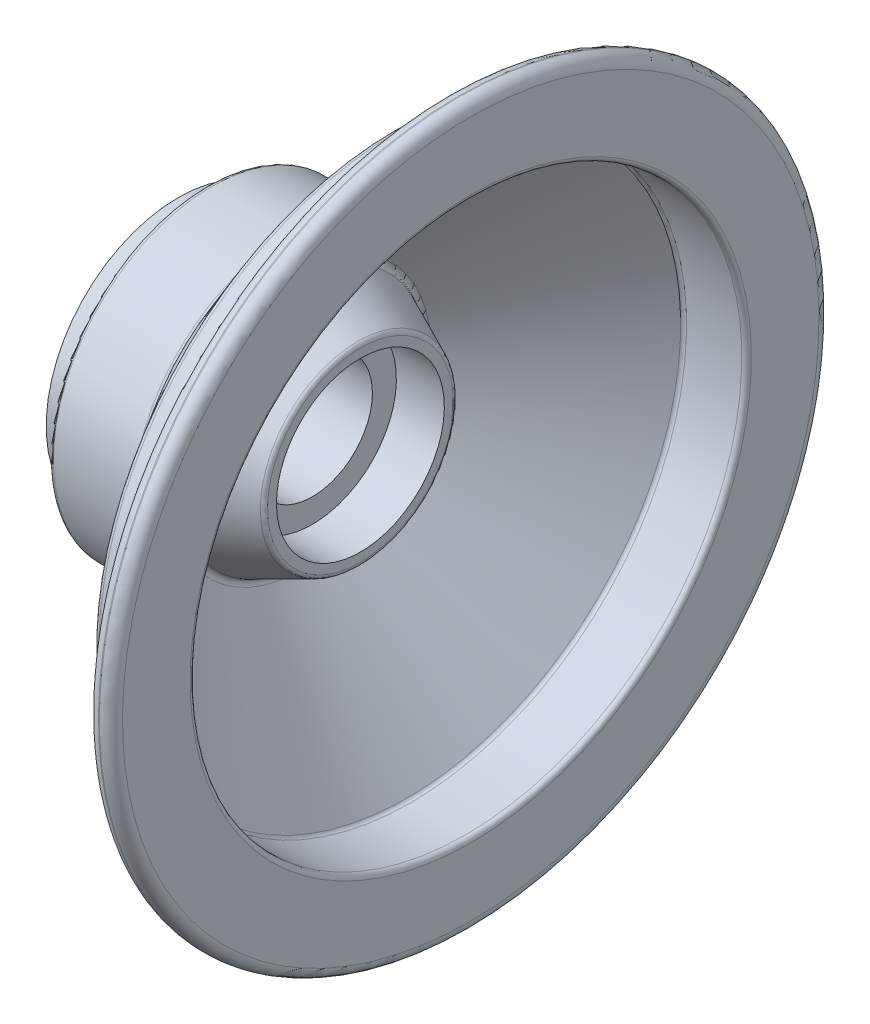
ISO-10303-21;
HEADER;
FILE_DESCRIPTION(('STEP AP214'),'2;1');
FILE_NAME('part.step','',(''),(''),'','','');
FILE_SCHEMA(('AUTOMOTIVE_DESIGN { 1 0 10303 214 1 1 1 1 }'));
ENDSEC;
DATA;
#1=APPLICATION_CONTEXT('core data for automotive mechanical design processes');
#2=APPLICATION_PROTOCOL_DEFINITION('international standard','automotive_design',2000,#1);
#3=PRODUCT_CONTEXT('',#1,'mechanical');
#4=PRODUCT('Part','Part','',(#3));
#5=PRODUCT_RELATED_PRODUCT_CATEGORY('part','',(#4));
#6=PRODUCT_DEFINITION_FORMATION('','',#4);
#7=PRODUCT_DEFINITION_CONTEXT('part definition',#1,'design');
#8=PRODUCT_DEFINITION('design','',#6,#7);
#9=PRODUCT_DEFINITION_SHAPE('','',#8);
#10=(LENGTH_UNIT() NAMED_UNIT(*) SI_UNIT(.MILLI.,.METRE.));
#11=(NAMED_UNIT(*) PLANE_ANGLE_UNIT() SI_UNIT($,.RADIAN.));
#12=(NAMED_UNIT(*) SI_UNIT($,.STERADIAN.) SOLID_ANGLE_UNIT());
#13=UNCERTAINTY_MEASURE_WITH_UNIT(LENGTH_MEASURE(1.E-05),#10,'distance_accuracy_value','');
#14=(GEOMETRIC_REPRESENTATION_CONTEXT(3) GLOBAL_UNCERTAINTY_ASSIGNED_CONTEXT((#13)) GLOBAL_UNIT_ASSIGNED_CONTEXT((#10,
#11,#12)) REPRESENTATION_CONTEXT('',''));
#15=CARTESIAN_POINT('',(0.,0.,0.));
#16=DIRECTION('',(0.,0.,1.));
#17=DIRECTION('',(1.,0.,0.));
#18=AXIS2_PLACEMENT_3D('',#15,#16,#17);
#19=CARTESIAN_POINT('',(60.0272416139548,0.,0.));
#20=DIRECTION('',(1.,0.,0.));
#21=DIRECTION('',(0.,1.,0.));
#22=AXIS2_PLACEMENT_3D('',#19,#20,#21);
#23=CYLINDRICAL_SURFACE('',#22,33.);
#24=CARTESIAN_POINT('',(17.4904745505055,0.,0.));
#25=DIRECTION('',(1.,0.,0.));
#26=DIRECTION('',(0.,1.,0.));
#27=AXIS2_PLACEMENT_3D('',#24,#25,#26);
#28=CIRCLE('',#27,33.);
#29=CARTESIAN_POINT('',(17.4904745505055,32.9999999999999,0.));
#30=VERTEX_POINT('',#29);
#31=EDGE_CURVE('E55',#30,#30,#28,.F.);
#32=ORIENTED_EDGE('',*,*,#31,.T.);
#33=EDGE_LOOP('',(#32));
#34=FACE_BOUND('',#33,.T.);
#35=CARTESIAN_POINT('',(0.99999999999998,0.,0.));
#36=DIRECTION('',(1.,0.,0.));
#37=DIRECTION('',(0.,1.,0.));
#38=AXIS2_PLACEMENT_3D('',#35,#36,#37);
#39=CIRCLE('',#38,33.);
#40=CARTESIAN_POINT('',(0.999999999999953,32.9999999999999,0.));
#41=VERTEX_POINT('',#40);
#42=EDGE_CURVE('E58',#41,#41,#39,.T.);
#43=ORIENTED_EDGE('',*,*,#42,.T.);
#44=EDGE_LOOP('',(#43));
#45=FACE_BOUND('',#44,.T.);
#46=ADVANCED_FACE('F30',(#34,#45),#23,.T.);
#47=CARTESIAN_POINT('',(0.,-27.5,0.));
#48=DIRECTION('',(1.,0.,0.));
#49=DIRECTION('',(0.,1.,0.));
#50=AXIS2_PLACEMENT_3D('',#47,#48,#49);
#51=PLANE('',#50);
#52=CARTESIAN_POINT('',(0.,0.,0.));
#53=DIRECTION('',(1.,0.,0.));
#54=DIRECTION('',(0.,1.,0.));
#55=AXIS2_PLACEMENT_3D('',#52,#53,#54);
#56=CIRCLE('',#55,32.);
#57=CARTESIAN_POINT('',(0.,31.9999999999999,0.));
#58=VERTEX_POINT('',#57);
#59=EDGE_CURVE('E52',#58,#58,#56,.F.);
#60=ORIENTED_EDGE('',*,*,#59,.T.);
#61=EDGE_LOOP('',(#60));
#62=FACE_BOUND('',#61,.T.);
#63=CARTESIAN_POINT('',(0.,0.,0.));
#64=DIRECTION('',(1.,0.,0.));
#65=DIRECTION('',(0.,1.,0.));
#66=AXIS2_PLACEMENT_3D('',#63,#64,#65);
#67=CIRCLE('',#66,27.5);
#68=CARTESIAN_POINT('',(0.,27.4999999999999,0.));
#69=VERTEX_POINT('',#68);
#70=EDGE_CURVE('E97',#69,#69,#67,.T.);
#71=ORIENTED_EDGE('',*,*,#70,.T.);
#72=EDGE_LOOP('',(#71));
#73=FACE_BOUND('',#72,.T.);
#74=ADVANCED_FACE('F187',(#62,#73),#51,.F.);
#75=CARTESIAN_POINT('',(60.0272416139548,0.,0.));
#76=DIRECTION('',(1.,0.,0.));
#77=DIRECTION('',(0.,1.,0.));
#78=AXIS2_PLACEMENT_3D('',#75,#76,#77);
#79=CYLINDRICAL_SURFACE('',#78,27.5);
#80=ORIENTED_EDGE('',*,*,#70,.F.);
#81=EDGE_LOOP('',(#80));
#82=FACE_BOUND('',#81,.T.);
#83=CARTESIAN_POINT('',(-6.00000000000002,0.,0.));
#84=DIRECTION('',(1.,0.,0.));
#85=DIRECTION('',(0.,1.,0.));
#86=AXIS2_PLACEMENT_3D('',#83,#84,#85);
#87=CIRCLE('',#86,27.5);
#88=CARTESIAN_POINT('',(-6.00000000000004,27.4999999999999,0.));
#89=VERTEX_POINT('',#88);
#90=EDGE_CURVE('E100',#89,#89,#87,.T.);
#91=ORIENTED_EDGE('',*,*,#90,.T.);
#92=EDGE_LOOP('',(#91));
#93=FACE_BOUND('',#92,.T.);
#94=ADVANCED_FACE('F146',(#82,#93),#79,.T.);
#95=CARTESIAN_POINT('',(-6.,-12.5,0.));
#96=DIRECTION('',(1.,0.,0.));
#97=DIRECTION('',(0.,1.,0.));
#98=AXIS2_PLACEMENT_3D('',#95,#96,#97);
#99=PLANE('',#98);
#100=CARTESIAN_POINT('',(-6.00000000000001,2.35999515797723E-13,-23.));
#101=DIRECTION('',(-1.,0.,0.));
#102=DIRECTION('',(0.,-1.,0.));
#103=AXIS2_PLACEMENT_3D('',#100,#101,#102);
#104=CIRCLE('',#103,2.5);
#105=CARTESIAN_POINT('',(-6.00000000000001,-2.49999999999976,-23.));
#106=VERTEX_POINT('',#105);
#107=EDGE_CURVE('E136',#106,#106,#104,.T.);
#108=ORIENTED_EDGE('',*,*,#107,.F.);
#109=EDGE_LOOP('',(#108));
#110=FACE_BOUND('',#109,.T.);
#111=CARTESIAN_POINT('',(-5.99999999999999,-23.,-1.60608234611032E-13));
#112=DIRECTION('',(-1.,0.,0.));
#113=DIRECTION('',(0.,-1.,0.));
#114=AXIS2_PLACEMENT_3D('',#111,#112,#113);
#115=CIRCLE('',#114,2.5);
#116=CARTESIAN_POINT('',(-5.99999999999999,-25.5,-1.60608234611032E-13));
#117=VERTEX_POINT('',#116);
#118=EDGE_CURVE('E130',#117,#117,#115,.T.);
#119=ORIENTED_EDGE('',*,*,#118,.F.);
#120=EDGE_LOOP('',(#119));
#121=FACE_BOUND('',#120,.T.);
#122=CARTESIAN_POINT('',(-6.00000000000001,0.,23.));
#123=DIRECTION('',(-1.,0.,0.));
#124=DIRECTION('',(0.,-1.,0.));
#125=AXIS2_PLACEMENT_3D('',#122,#123,#124);
#126=CIRCLE('',#125,2.5);
#127=CARTESIAN_POINT('',(-6.00000000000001,-2.50000000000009,23.));
#128=VERTEX_POINT('',#127);
#129=EDGE_CURVE('E124',#128,#128,#126,.T.);
#130=ORIENTED_EDGE('',*,*,#129,.F.);
#131=EDGE_LOOP('',(#130));
#132=FACE_BOUND('',#131,.T.);
#133=CARTESIAN_POINT('',(-6.00000000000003,23.,0.));
#134=DIRECTION('',(-1.,0.,0.));
#135=DIRECTION('',(0.,-1.,0.));
#136=AXIS2_PLACEMENT_3D('',#133,#134,#135);
#137=CIRCLE('',#136,2.5);
#138=CARTESIAN_POINT('',(-6.00000000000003,20.5,0.));
#139=VERTEX_POINT('',#138);
#140=EDGE_CURVE('E118',#139,#139,#137,.T.);
#141=ORIENTED_EDGE('',*,*,#140,.F.);
#142=EDGE_LOOP('',(#141));
#143=FACE_BOUND('',#142,.T.);
#144=ORIENTED_EDGE('',*,*,#90,.F.);
#145=EDGE_LOOP('',(#144));
#146=FACE_BOUND('',#145,.T.);
#147=CARTESIAN_POINT('',(-6.00000000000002,0.,0.));
#148=DIRECTION('',(1.,0.,0.));
#149=DIRECTION('',(0.,1.,0.));
#150=AXIS2_PLACEMENT_3D('',#147,#148,#149);
#151=CIRCLE('',#150,12.5);
#152=CARTESIAN_POINT('',(-6.00000000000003,12.4999999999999,0.));
#153=VERTEX_POINT('',#152);
#154=EDGE_CURVE('E103',#153,#153,#151,.T.);
#155=ORIENTED_EDGE('',*,*,#154,.T.);
#156=EDGE_LOOP('',(#155));
#157=FACE_BOUND('',#156,.T.);
#158=ADVANCED_FACE('F142',(#110,#121,#132,#143,#146,#157),#99,.F.);
#159=CARTESIAN_POINT('',(60.0272416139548,0.,0.));
#160=DIRECTION('',(1.,0.,0.));
#161=DIRECTION('',(0.,1.,0.));
#162=AXIS2_PLACEMENT_3D('',#159,#160,#161);
#163=CYLINDRICAL_SURFACE('',#162,12.5);
#164=ORIENTED_EDGE('',*,*,#154,.F.);
#165=EDGE_LOOP('',(#164));
#166=FACE_BOUND('',#165,.T.);
#167=CARTESIAN_POINT('',(22.,0.,0.));
#168=DIRECTION('',(1.,0.,0.));
#169=DIRECTION('',(0.,1.,0.));
#170=AXIS2_PLACEMENT_3D('',#167,#168,#169);
#171=CIRCLE('',#170,12.5);
#172=CARTESIAN_POINT('',(22.,12.4999999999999,0.));
#173=VERTEX_POINT('',#172);
#174=EDGE_CURVE('E106',#173,#173,#171,.T.);
#175=ORIENTED_EDGE('',*,*,#174,.T.);
#176=EDGE_LOOP('',(#175));
#177=FACE_BOUND('',#176,.T.);
#178=ADVANCED_FACE('F145',(#166,#177),#163,.F.);
#179=CARTESIAN_POINT('',(22.,-12.5,0.));
#180=DIRECTION('',(-1.,0.,0.));
#181=DIRECTION('',(0.,-1.,0.));
#182=AXIS2_PLACEMENT_3D('',#179,#180,#181);
#183=PLANE('',#182);
#184=ORIENTED_EDGE('',*,*,#174,.F.);
#185=EDGE_LOOP('',(#184));
#186=FACE_BOUND('',#185,.T.);
#187=CARTESIAN_POINT('',(22.,0.,0.));
#188=DIRECTION('',(1.,0.,0.));
#189=DIRECTION('',(0.,1.,0.));
#190=AXIS2_PLACEMENT_3D('',#187,#188,#189);
#191=CIRCLE('',#190,17.5);
#192=CARTESIAN_POINT('',(22.,17.4999999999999,0.));
#193=VERTEX_POINT('',#192);
#194=EDGE_CURVE('E109',#193,#193,#191,.T.);
#195=ORIENTED_EDGE('',*,*,#194,.T.);
#196=EDGE_LOOP('',(#195));
#197=FACE_BOUND('',#196,.T.);
#198=ADVANCED_FACE('F160',(#186,#197),#183,.F.);
#199=CARTESIAN_POINT('',(60.0272416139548,0.,0.));
#200=DIRECTION('',(1.,0.,0.));
#201=DIRECTION('',(0.,1.,0.));
#202=AXIS2_PLACEMENT_3D('',#199,#200,#201);
#203=CYLINDRICAL_SURFACE('',#202,17.5);
#204=ORIENTED_EDGE('',*,*,#194,.F.);
#205=EDGE_LOOP('',(#204));
#206=FACE_BOUND('',#205,.T.);
#207=CARTESIAN_POINT('',(32.,0.,0.));
#208=DIRECTION('',(1.,0.,0.));
#209=DIRECTION('',(0.,1.,0.));
#210=AXIS2_PLACEMENT_3D('',#207,#208,#209);
#211=CIRCLE('',#210,17.5);
#212=CARTESIAN_POINT('',(32.,17.5,0.));
#213=VERTEX_POINT('',#212);
#214=EDGE_CURVE('E112',#213,#213,#211,.T.);
#215=ORIENTED_EDGE('',*,*,#214,.T.);
#216=EDGE_LOOP('',(#215));
#217=FACE_BOUND('',#216,.T.);
#218=ADVANCED_FACE('F166',(#206,#217),#203,.F.);
#219=CARTESIAN_POINT('',(32.,-20.,0.));
#220=DIRECTION('',(-1.,0.,0.));
#221=DIRECTION('',(0.,-1.,0.));
#222=AXIS2_PLACEMENT_3D('',#219,#220,#221);
#223=PLANE('',#222);
#224=CARTESIAN_POINT('',(32.,0.,0.));
#225=DIRECTION('',(-1.,0.,0.));
#226=DIRECTION('',(0.,-1.,0.));
#227=AXIS2_PLACEMENT_3D('',#224,#225,#226);
#228=CIRCLE('',#227,19.354314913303);
#229=CARTESIAN_POINT('',(32.,-19.3543149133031,0.));
#230=VERTEX_POINT('',#229);
#231=EDGE_CURVE('E82',#230,#230,#228,.F.);
#232=ORIENTED_EDGE('',*,*,#231,.T.);
#233=EDGE_LOOP('',(#232));
#234=FACE_BOUND('',#233,.T.);
#235=ORIENTED_EDGE('',*,*,#214,.F.);
#236=EDGE_LOOP('',(#235));
#237=FACE_BOUND('',#236,.T.);
#238=ADVANCED_FACE('F172',(#234,#237),#223,.F.);
#239=CARTESIAN_POINT('',(19.,0.,0.));
#240=DIRECTION('',(-1.,0.,0.));
#241=DIRECTION('',(0.,-1.,0.));
#242=AXIS2_PLACEMENT_3D('',#239,#240,#241);
#243=CONICAL_SURFACE('',#242,25.8698738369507,0.42412451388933);
#244=CARTESIAN_POINT('',(31.4115230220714,0.,0.));
#245=DIRECTION('',(1.,0.,0.));
#246=DIRECTION('',(0.,1.,0.));
#247=AXIS2_PLACEMENT_3D('',#244,#245,#246);
#248=CIRCLE('',#247,20.2657142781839);
#249=CARTESIAN_POINT('',(31.4115230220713,20.2657142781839,0.));
#250=VERTEX_POINT('',#249);
#251=EDGE_CURVE('E76',#250,#250,#248,.F.);
#252=ORIENTED_EDGE('',*,*,#251,.T.);
#253=EDGE_LOOP('',(#252));
#254=FACE_BOUND('',#253,.T.);
#255=CARTESIAN_POINT('',(20.119468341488,0.,0.));
#256=DIRECTION('',(-1.,0.,0.));
#257=DIRECTION('',(0.,-1.,0.));
#258=AXIS2_PLACEMENT_3D('',#255,#256,#257);
#259=CIRCLE('',#258,25.3644016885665);
#260=CARTESIAN_POINT('',(20.119468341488,-25.3644016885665,0.));
#261=VERTEX_POINT('',#260);
#262=EDGE_CURVE('E79',#261,#261,#259,.F.);
#263=ORIENTED_EDGE('',*,*,#262,.T.);
#264=EDGE_LOOP('',(#263));
#265=FACE_BOUND('',#264,.T.);
#266=ADVANCED_FACE('F177',(#254,#265),#243,.T.);
#267=CARTESIAN_POINT('',(41.9806318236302,0.,0.));
#268=DIRECTION('',(1.,0.,0.));
#269=DIRECTION('',(0.,1.,0.));
#270=AXIS2_PLACEMENT_3D('',#267,#268,#269);
#271=CONICAL_SURFACE('',#270,57.5,0.942477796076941);
#272=CARTESIAN_POINT('',(41.6811402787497,0.,0.));
#273=DIRECTION('',(1.,0.,0.));
#274=DIRECTION('',(0.,1.,0.));
#275=AXIS2_PLACEMENT_3D('',#272,#273,#274);
#276=CIRCLE('',#275,57.0877852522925);
#277=CARTESIAN_POINT('',(41.6811402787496,57.0877852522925,0.));
#278=VERTEX_POINT('',#277);
#279=EDGE_CURVE('E44',#278,#278,#276,.T.);
#280=ORIENTED_EDGE('',*,*,#279,.T.);
#281=EDGE_LOOP('',(#280));
#282=FACE_BOUND('',#281,.T.);
#283=CARTESIAN_POINT('',(19.7219743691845,0.,0.));
#284=DIRECTION('',(1.,0.,0.));
#285=DIRECTION('',(0.,1.,0.));
#286=AXIS2_PLACEMENT_3D('',#283,#284,#285);
#287=CIRCLE('',#286,26.8635863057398);
#288=CARTESIAN_POINT('',(19.7219743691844,26.8635863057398,0.));
#289=VERTEX_POINT('',#288);
#290=EDGE_CURVE('E49',#289,#289,#287,.F.);
#291=ORIENTED_EDGE('',*,*,#290,.T.);
#292=EDGE_LOOP('',(#291));
#293=FACE_BOUND('',#292,.T.);
#294=ADVANCED_FACE('F183',(#282,#293),#271,.F.);
#295=CARTESIAN_POINT('',(60.0272416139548,0.,0.));
#296=DIRECTION('',(1.,0.,0.));
#297=DIRECTION('',(0.,1.,0.));
#298=AXIS2_PLACEMENT_3D('',#295,#296,#297);
#299=CYLINDRICAL_SURFACE('',#298,57.5);
#300=CARTESIAN_POINT('',(42.4901572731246,0.,0.));
#301=DIRECTION('',(1.,0.,0.));
#302=DIRECTION('',(0.,1.,0.));
#303=AXIS2_PLACEMENT_3D('',#300,#301,#302);
#304=CIRCLE('',#303,57.5);
#305=CARTESIAN_POINT('',(42.4901572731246,57.5,0.));
#306=VERTEX_POINT('',#305);
#307=EDGE_CURVE('E36',#306,#306,#304,.F.);
#308=ORIENTED_EDGE('',*,*,#307,.T.);
#309=EDGE_LOOP('',(#308));
#310=FACE_BOUND('',#309,.T.);
#311=CARTESIAN_POINT('',(53.9999999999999,0.,0.));
#312=DIRECTION('',(-1.,0.,0.));
#313=DIRECTION('',(0.,-1.,0.));
#314=AXIS2_PLACEMENT_3D('',#311,#312,#313);
#315=CIRCLE('',#314,57.5);
#316=CARTESIAN_POINT('',(54.,-57.5,0.));
#317=VERTEX_POINT('',#316);
#318=EDGE_CURVE('E40',#317,#317,#315,.F.);
#319=ORIENTED_EDGE('',*,*,#318,.T.);
#320=EDGE_LOOP('',(#319));
#321=FACE_BOUND('',#320,.T.);
#322=ADVANCED_FACE('F254',(#310,#321),#299,.F.);
#323=CARTESIAN_POINT('',(55.,-75.,0.));
#324=DIRECTION('',(-1.,0.,0.));
#325=DIRECTION('',(0.,-1.,0.));
#326=AXIS2_PLACEMENT_3D('',#323,#324,#325);
#327=PLANE('',#326);
#328=CARTESIAN_POINT('',(54.9999999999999,0.,0.));
#329=DIRECTION('',(-1.,0.,0.));
#330=DIRECTION('',(0.,-1.,0.));
#331=AXIS2_PLACEMENT_3D('',#328,#329,#330);
#332=CIRCLE('',#331,58.5);
#333=CARTESIAN_POINT('',(55.,-58.5,0.));
#334=VERTEX_POINT('',#333);
#335=EDGE_CURVE('E10',#334,#334,#332,.T.);
#336=ORIENTED_EDGE('',*,*,#335,.T.);
#337=EDGE_LOOP('',(#336));
#338=FACE_BOUND('',#337,.T.);
#339=CARTESIAN_POINT('',(54.9999999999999,0.,0.));
#340=DIRECTION('',(-1.,0.,0.));
#341=DIRECTION('',(0.,-1.,0.));
#342=AXIS2_PLACEMENT_3D('',#339,#340,#341);
#343=CIRCLE('',#342,72.6);
#344=CARTESIAN_POINT('',(55.,-72.6,0.));
#345=VERTEX_POINT('',#344);
#346=EDGE_CURVE('E85',#345,#345,#343,.F.);
#347=ORIENTED_EDGE('',*,*,#346,.T.);
#348=EDGE_LOOP('',(#347));
#349=FACE_BOUND('',#348,.T.);
#350=ADVANCED_FACE('F250',(#338,#349),#327,.F.);
#351=CARTESIAN_POINT('',(60.0272416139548,0.,0.));
#352=DIRECTION('',(1.,0.,0.));
#353=DIRECTION('',(0.,1.,0.));
#354=AXIS2_PLACEMENT_3D('',#351,#352,#353);
#355=CYLINDRICAL_SURFACE('',#354,75.);
#356=CARTESIAN_POINT('',(52.4,0.,0.));
#357=DIRECTION('',(1.,0.,0.));
#358=DIRECTION('',(0.,1.,0.));
#359=AXIS2_PLACEMENT_3D('',#356,#357,#358);
#360=CIRCLE('',#359,75.);
#361=CARTESIAN_POINT('',(52.3999999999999,75.,0.));
#362=VERTEX_POINT('',#361);
#363=EDGE_CURVE('E91',#362,#362,#360,.T.);
#364=ORIENTED_EDGE('',*,*,#363,.T.);
#365=EDGE_LOOP('',(#364));
#366=FACE_BOUND('',#365,.T.);
#367=CARTESIAN_POINT('',(52.5999999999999,0.,0.));
#368=DIRECTION('',(-1.,0.,0.));
#369=DIRECTION('',(0.,-1.,0.));
#370=AXIS2_PLACEMENT_3D('',#367,#368,#369);
#371=CIRCLE('',#370,75.);
#372=CARTESIAN_POINT('',(52.6,-75.,0.));
#373=VERTEX_POINT('',#372);
#374=EDGE_CURVE('E94',#373,#373,#371,.T.);
#375=ORIENTED_EDGE('',*,*,#374,.T.);
#376=EDGE_LOOP('',(#375));
#377=FACE_BOUND('',#376,.T.);
#378=ADVANCED_FACE('F246',(#366,#377),#355,.T.);
#379=CARTESIAN_POINT('',(50.,-62.5,0.));
#380=DIRECTION('',(1.,0.,0.));
#381=DIRECTION('',(0.,1.,0.));
#382=AXIS2_PLACEMENT_3D('',#379,#380,#381);
#383=PLANE('',#382);
#384=CARTESIAN_POINT('',(50.,0.,0.));
#385=DIRECTION('',(1.,0.,0.));
#386=DIRECTION('',(0.,1.,0.));
#387=AXIS2_PLACEMENT_3D('',#384,#385,#386);
#388=CIRCLE('',#387,63.5);
#389=CARTESIAN_POINT('',(49.9999999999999,63.5,0.));
#390=VERTEX_POINT('',#389);
#391=EDGE_CURVE('E73',#390,#390,#388,.T.);
#392=ORIENTED_EDGE('',*,*,#391,.T.);
#393=EDGE_LOOP('',(#392));
#394=FACE_BOUND('',#393,.T.);
#395=CARTESIAN_POINT('',(50.,0.,0.));
#396=DIRECTION('',(1.,0.,0.));
#397=DIRECTION('',(0.,1.,0.));
#398=AXIS2_PLACEMENT_3D('',#395,#396,#397);
#399=CIRCLE('',#398,72.6);
#400=CARTESIAN_POINT('',(49.9999999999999,72.6,0.));
#401=VERTEX_POINT('',#400);
#402=EDGE_CURVE('E88',#401,#401,#399,.F.);
#403=ORIENTED_EDGE('',*,*,#402,.T.);
#404=EDGE_LOOP('',(#403));
#405=FACE_BOUND('',#404,.T.);
#406=ADVANCED_FACE('F242',(#394,#405),#383,.F.);
#407=CARTESIAN_POINT('',(60.0272416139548,0.,0.));
#408=DIRECTION('',(1.,0.,0.));
#409=DIRECTION('',(0.,1.,0.));
#410=AXIS2_PLACEMENT_3D('',#407,#408,#409);
#411=CYLINDRICAL_SURFACE('',#410,62.5);
#412=CARTESIAN_POINT('',(49.,0.,0.));
#413=DIRECTION('',(1.,0.,0.));
#414=DIRECTION('',(0.,1.,0.));
#415=AXIS2_PLACEMENT_3D('',#412,#413,#414);
#416=CIRCLE('',#415,62.5);
#417=CARTESIAN_POINT('',(48.9999999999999,62.5,0.));
#418=VERTEX_POINT('',#417);
#419=EDGE_CURVE('E67',#418,#418,#416,.F.);
#420=ORIENTED_EDGE('',*,*,#419,.T.);
#421=EDGE_LOOP('',(#420));
#422=FACE_BOUND('',#421,.T.);
#423=CARTESIAN_POINT('',(39.9425300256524,0.,0.));
#424=DIRECTION('',(-1.,0.,0.));
#425=DIRECTION('',(0.,-1.,0.));
#426=AXIS2_PLACEMENT_3D('',#423,#424,#425);
#427=CIRCLE('',#426,62.5);
#428=CARTESIAN_POINT('',(39.9425300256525,-62.5,0.));
#429=VERTEX_POINT('',#428);
#430=EDGE_CURVE('E70',#429,#429,#427,.F.);
#431=ORIENTED_EDGE('',*,*,#430,.T.);
#432=EDGE_LOOP('',(#431));
#433=FACE_BOUND('',#432,.T.);
#434=ADVANCED_FACE('F238',(#422,#433),#411,.T.);
#435=CARTESIAN_POINT('',(18.,0.,0.));
#436=DIRECTION('',(1.,0.,0.));
#437=DIRECTION('',(0.,1.,0.));
#438=AXIS2_PLACEMENT_3D('',#435,#436,#437);
#439=CONICAL_SURFACE('',#438,33.,0.942477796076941);
#440=CARTESIAN_POINT('',(39.1335130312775,0.,0.));
#441=DIRECTION('',(-1.,0.,0.));
#442=DIRECTION('',(0.,-1.,0.));
#443=AXIS2_PLACEMENT_3D('',#440,#441,#442);
#444=CIRCLE('',#443,62.0877852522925);
#445=CARTESIAN_POINT('',(39.1335130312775,-62.0877852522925,0.));
#446=VERTEX_POINT('',#445);
#447=EDGE_CURVE('E61',#446,#446,#444,.T.);
#448=ORIENTED_EDGE('',*,*,#447,.T.);
#449=EDGE_LOOP('',(#448));
#450=FACE_BOUND('',#449,.T.);
#451=CARTESIAN_POINT('',(18.2994915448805,0.,0.));
#452=DIRECTION('',(1.,0.,0.));
#453=DIRECTION('',(0.,1.,0.));
#454=AXIS2_PLACEMENT_3D('',#451,#452,#453);
#455=CIRCLE('',#454,33.4122147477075);
#456=CARTESIAN_POINT('',(18.2994915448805,33.4122147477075,0.));
#457=VERTEX_POINT('',#456);
#458=EDGE_CURVE('E64',#457,#457,#455,.T.);
#459=ORIENTED_EDGE('',*,*,#458,.T.);
#460=EDGE_LOOP('',(#459));
#461=FACE_BOUND('',#460,.T.);
#462=ADVANCED_FACE('F234',(#450,#461),#439,.T.);
#463=CARTESIAN_POINT('',(52.4,0.,0.));
#464=DIRECTION('',(1.,0.,0.));
#465=DIRECTION('',(0.,1.,0.));
#466=AXIS2_PLACEMENT_3D('',#463,#464,#465);
#467=TOROIDAL_SURFACE('',#466,72.6,2.4);
#468=ORIENTED_EDGE('',*,*,#402,.F.);
#469=EDGE_LOOP('',(#468));
#470=FACE_BOUND('',#469,.T.);
#471=ORIENTED_EDGE('',*,*,#363,.F.);
#472=EDGE_LOOP('',(#471));
#473=FACE_BOUND('',#472,.T.);
#474=ADVANCED_FACE('F230',(#470,#473),#467,.T.);
#475=CARTESIAN_POINT('',(52.5999999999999,0.,0.));
#476=DIRECTION('',(-1.,0.,0.));
#477=DIRECTION('',(0.,-1.,0.));
#478=AXIS2_PLACEMENT_3D('',#475,#476,#477);
#479=TOROIDAL_SURFACE('',#478,72.6,2.4);
#480=ORIENTED_EDGE('',*,*,#374,.F.);
#481=EDGE_LOOP('',(#480));
#482=FACE_BOUND('',#481,.T.);
#483=ORIENTED_EDGE('',*,*,#346,.F.);
#484=EDGE_LOOP('',(#483));
#485=FACE_BOUND('',#484,.T.);
#486=ADVANCED_FACE('F226',(#482,#485),#479,.T.);
#487=CARTESIAN_POINT('',(31.,0.,0.));
#488=DIRECTION('',(-1.,0.,0.));
#489=DIRECTION('',(0.,-1.,0.));
#490=AXIS2_PLACEMENT_3D('',#487,#488,#489);
#491=TOROIDAL_SURFACE('',#490,19.354314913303,1.);
#492=ORIENTED_EDGE('',*,*,#251,.F.);
#493=EDGE_LOOP('',(#492));
#494=FACE_BOUND('',#493,.T.);
#495=ORIENTED_EDGE('',*,*,#231,.F.);
#496=EDGE_LOOP('',(#495));
#497=FACE_BOUND('',#496,.T.);
#498=ADVANCED_FACE('F222',(#494,#497),#491,.T.);
#499=CARTESIAN_POINT('',(49.,0.,0.));
#500=DIRECTION('',(1.,0.,0.));
#501=DIRECTION('',(0.,1.,0.));
#502=AXIS2_PLACEMENT_3D('',#499,#500,#501);
#503=TOROIDAL_SURFACE('',#502,63.5,1.);
#504=ORIENTED_EDGE('',*,*,#419,.F.);
#505=EDGE_LOOP('',(#504));
#506=FACE_BOUND('',#505,.T.);
#507=ORIENTED_EDGE('',*,*,#391,.F.);
#508=EDGE_LOOP('',(#507));
#509=FACE_BOUND('',#508,.T.);
#510=ADVANCED_FACE('F218',(#506,#509),#503,.F.);
#511=CARTESIAN_POINT('',(39.9425300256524,0.,0.));
#512=DIRECTION('',(-1.,0.,0.));
#513=DIRECTION('',(0.,-1.,0.));
#514=AXIS2_PLACEMENT_3D('',#511,#512,#513);
#515=TOROIDAL_SURFACE('',#514,61.5,1.);
#516=ORIENTED_EDGE('',*,*,#447,.F.);
#517=EDGE_LOOP('',(#516));
#518=FACE_BOUND('',#517,.T.);
#519=ORIENTED_EDGE('',*,*,#430,.F.);
#520=EDGE_LOOP('',(#519));
#521=FACE_BOUND('',#520,.T.);
#522=ADVANCED_FACE('F210',(#518,#521),#515,.T.);
#523=CARTESIAN_POINT('',(17.4904745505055,0.,0.));
#524=DIRECTION('',(1.,0.,0.));
#525=DIRECTION('',(0.,1.,0.));
#526=AXIS2_PLACEMENT_3D('',#523,#524,#525);
#527=TOROIDAL_SURFACE('',#526,34.,1.);
#528=ORIENTED_EDGE('',*,*,#31,.F.);
#529=EDGE_LOOP('',(#528));
#530=FACE_BOUND('',#529,.T.);
#531=ORIENTED_EDGE('',*,*,#458,.F.);
#532=EDGE_LOOP('',(#531));
#533=FACE_BOUND('',#532,.T.);
#534=ADVANCED_FACE('F200',(#530,#533),#527,.F.);
#535=CARTESIAN_POINT('',(0.99999999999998,0.,0.));
#536=DIRECTION('',(1.,0.,0.));
#537=DIRECTION('',(0.,1.,0.));
#538=AXIS2_PLACEMENT_3D('',#535,#536,#537);
#539=TOROIDAL_SURFACE('',#538,32.,1.);
#540=ORIENTED_EDGE('',*,*,#59,.F.);
#541=EDGE_LOOP('',(#540));
#542=FACE_BOUND('',#541,.T.);
#543=ORIENTED_EDGE('',*,*,#42,.F.);
#544=EDGE_LOOP('',(#543));
#545=FACE_BOUND('',#544,.T.);
#546=ADVANCED_FACE('F197',(#542,#545),#539,.T.);
#547=CARTESIAN_POINT('',(42.4901572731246,0.,0.));
#548=DIRECTION('',(1.,0.,0.));
#549=DIRECTION('',(0.,1.,0.));
#550=AXIS2_PLACEMENT_3D('',#547,#548,#549);
#551=TOROIDAL_SURFACE('',#550,56.5,1.);
#552=ORIENTED_EDGE('',*,*,#307,.F.);
#553=EDGE_LOOP('',(#552));
#554=FACE_BOUND('',#553,.T.);
#555=ORIENTED_EDGE('',*,*,#279,.F.);
#556=EDGE_LOOP('',(#555));
#557=FACE_BOUND('',#556,.T.);
#558=ADVANCED_FACE('F199',(#554,#557),#551,.F.);
#559=CARTESIAN_POINT('',(53.9999999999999,0.,0.));
#560=DIRECTION('',(-1.,0.,0.));
#561=DIRECTION('',(0.,-1.,0.));
#562=AXIS2_PLACEMENT_3D('',#559,#560,#561);
#563=TOROIDAL_SURFACE('',#562,58.5,1.);
#564=ORIENTED_EDGE('',*,*,#335,.F.);
#565=EDGE_LOOP('',(#564));
#566=FACE_BOUND('',#565,.T.);
#567=ORIENTED_EDGE('',*,*,#318,.F.);
#568=EDGE_LOOP('',(#567));
#569=FACE_BOUND('',#568,.T.);
#570=ADVANCED_FACE('F207',(#566,#569),#563,.T.);
#571=CARTESIAN_POINT('',(20.5309913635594,0.,0.));
#572=DIRECTION('',(1.,0.,0.));
#573=DIRECTION('',(0.,1.,0.));
#574=AXIS2_PLACEMENT_3D('',#571,#572,#573);
#575=TOROIDAL_SURFACE('',#574,26.2758010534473,1.);
#576=ORIENTED_EDGE('',*,*,#290,.F.);
#577=EDGE_LOOP('',(#576));
#578=FACE_BOUND('',#577,.T.);
#579=ORIENTED_EDGE('',*,*,#262,.F.);
#580=EDGE_LOOP('',(#579));
#581=FACE_BOUND('',#580,.T.);
#582=ADVANCED_FACE('F265',(#578,#581),#575,.F.);
#583=CARTESIAN_POINT('',(12.,23.,0.));
#584=DIRECTION('',(-1.,0.,0.));
#585=DIRECTION('',(0.,-1.,0.));
#586=AXIS2_PLACEMENT_3D('',#583,#584,#585);
#587=CYLINDRICAL_SURFACE('',#586,2.5);
#588=CARTESIAN_POINT('',(12.,23.,0.));
#589=DIRECTION('',(-1.,0.,0.));
#590=DIRECTION('',(0.,-1.,0.));
#591=AXIS2_PLACEMENT_3D('',#588,#589,#590);
#592=CIRCLE('',#591,2.5);
#593=CARTESIAN_POINT('',(12.,20.5,0.));
#594=VERTEX_POINT('',#593);
#595=EDGE_CURVE('E115',#594,#594,#592,.T.);
#596=ORIENTED_EDGE('',*,*,#595,.F.);
#597=EDGE_LOOP('',(#596));
#598=FACE_BOUND('',#597,.T.);
#599=ORIENTED_EDGE('',*,*,#140,.T.);
#600=EDGE_LOOP('',(#599));
#601=FACE_BOUND('',#600,.T.);
#602=ADVANCED_FACE('F268',(#598,#601),#587,.F.);
#603=CARTESIAN_POINT('',(12.,23.,0.));
#604=DIRECTION('',(-1.,0.,0.));
#605=DIRECTION('',(0.,-1.,0.));
#606=AXIS2_PLACEMENT_3D('',#603,#604,#605);
#607=PLANE('',#606);
#608=ORIENTED_EDGE('',*,*,#595,.T.);
#609=EDGE_LOOP('',(#608));
#610=FACE_BOUND('',#609,.T.);
#611=ADVANCED_FACE('F276',(#610),#607,.T.);
#612=CARTESIAN_POINT('',(12.,0.,23.));
#613=DIRECTION('',(-1.,0.,0.));
#614=DIRECTION('',(0.,-1.,0.));
#615=AXIS2_PLACEMENT_3D('',#612,#613,#614);
#616=CYLINDRICAL_SURFACE('',#615,2.5);
#617=CARTESIAN_POINT('',(12.,0.,23.));
#618=DIRECTION('',(-1.,0.,0.));
#619=DIRECTION('',(0.,-1.,0.));
#620=AXIS2_PLACEMENT_3D('',#617,#618,#619);
#621=CIRCLE('',#620,2.5);
#622=CARTESIAN_POINT('',(12.,-2.50000000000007,23.));
#623=VERTEX_POINT('',#622);
#624=EDGE_CURVE('E121',#623,#623,#621,.T.);
#625=ORIENTED_EDGE('',*,*,#624,.F.);
#626=EDGE_LOOP('',(#625));
#627=FACE_BOUND('',#626,.T.);
#628=ORIENTED_EDGE('',*,*,#129,.T.);
#629=EDGE_LOOP('',(#628));
#630=FACE_BOUND('',#629,.T.);
#631=ADVANCED_FACE('F283',(#627,#630),#616,.F.);
#632=CARTESIAN_POINT('',(12.,0.,23.));
#633=DIRECTION('',(-1.,0.,0.));
#634=DIRECTION('',(0.,-1.,0.));
#635=AXIS2_PLACEMENT_3D('',#632,#633,#634);
#636=PLANE('',#635);
#637=ORIENTED_EDGE('',*,*,#624,.T.);
#638=EDGE_LOOP('',(#637));
#639=FACE_BOUND('',#638,.T.);
#640=ADVANCED_FACE('F287',(#639),#636,.T.);
#641=CARTESIAN_POINT('',(12.,-23.,-1.60608234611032E-13));
#642=DIRECTION('',(-1.,0.,0.));
#643=DIRECTION('',(0.,-1.,0.));
#644=AXIS2_PLACEMENT_3D('',#641,#642,#643);
#645=CYLINDRICAL_SURFACE('',#644,2.5);
#646=CARTESIAN_POINT('',(12.,-23.,-1.60608234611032E-13));
#647=DIRECTION('',(-1.,0.,0.));
#648=DIRECTION('',(0.,-1.,0.));
#649=AXIS2_PLACEMENT_3D('',#646,#647,#648);
#650=CIRCLE('',#649,2.5);
#651=CARTESIAN_POINT('',(12.,-25.5,-1.60608234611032E-13));
#652=VERTEX_POINT('',#651);
#653=EDGE_CURVE('E127',#652,#652,#650,.T.);
#654=ORIENTED_EDGE('',*,*,#653,.F.);
#655=EDGE_LOOP('',(#654));
#656=FACE_BOUND('',#655,.T.);
#657=ORIENTED_EDGE('',*,*,#118,.T.);
#658=EDGE_LOOP('',(#657));
#659=FACE_BOUND('',#658,.T.);
#660=ADVANCED_FACE('F291',(#656,#659),#645,.F.);
#661=CARTESIAN_POINT('',(12.,-23.,-1.60608234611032E-13));
#662=DIRECTION('',(-1.,0.,0.));
#663=DIRECTION('',(0.,-1.,0.));
#664=AXIS2_PLACEMENT_3D('',#661,#662,#663);
#665=PLANE('',#664);
#666=ORIENTED_EDGE('',*,*,#653,.T.);
#667=EDGE_LOOP('',(#666));
#668=FACE_BOUND('',#667,.T.);
#669=ADVANCED_FACE('F295',(#668),#665,.T.);
#670=CARTESIAN_POINT('',(12.,2.50738024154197E-13,-23.));
#671=DIRECTION('',(-1.,0.,0.));
#672=DIRECTION('',(0.,-1.,0.));
#673=AXIS2_PLACEMENT_3D('',#670,#671,#672);
#674=CYLINDRICAL_SURFACE('',#673,2.5);
#675=CARTESIAN_POINT('',(12.,2.50738024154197E-13,-23.));
#676=DIRECTION('',(-1.,0.,0.));
#677=DIRECTION('',(0.,-1.,0.));
#678=AXIS2_PLACEMENT_3D('',#675,#676,#677);
#679=CIRCLE('',#678,2.5);
#680=CARTESIAN_POINT('',(12.,-2.49999999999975,-23.));
#681=VERTEX_POINT('',#680);
#682=EDGE_CURVE('E133',#681,#681,#679,.T.);
#683=ORIENTED_EDGE('',*,*,#682,.F.);
#684=EDGE_LOOP('',(#683));
#685=FACE_BOUND('',#684,.T.);
#686=ORIENTED_EDGE('',*,*,#107,.T.);
#687=EDGE_LOOP('',(#686));
#688=FACE_BOUND('',#687,.T.);
#689=ADVANCED_FACE('F140',(#685,#688),#674,.F.);
#690=CARTESIAN_POINT('',(12.,2.50738024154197E-13,-23.));
#691=DIRECTION('',(-1.,0.,0.));
#692=DIRECTION('',(0.,-1.,0.));
#693=AXIS2_PLACEMENT_3D('',#690,#691,#692);
#694=PLANE('',#693);
#695=ORIENTED_EDGE('',*,*,#682,.T.);
#696=EDGE_LOOP('',(#695));
#697=FACE_BOUND('',#696,.T.);
#698=ADVANCED_FACE('F302',(#697),#694,.T.);
#699=CLOSED_SHELL('',(#46,#74,#94,#158,#178,#198,#218,#238,#266,#294,#322,#350,#378,#406,#434,
#462,#474,#486,#498,#510,#522,#534,#546,#558,#570,#582,#602,#611,#631,#640,#660,#669,#689,#698));
#700=MANIFOLD_SOLID_BREP('B2',#699);
#701=ADVANCED_BREP_SHAPE_REPRESENTATION('',(#18,#700),#14);
#702=SHAPE_DEFINITION_REPRESENTATION(#9,#701);
ENDSEC;
END-ISO-10303-21;
